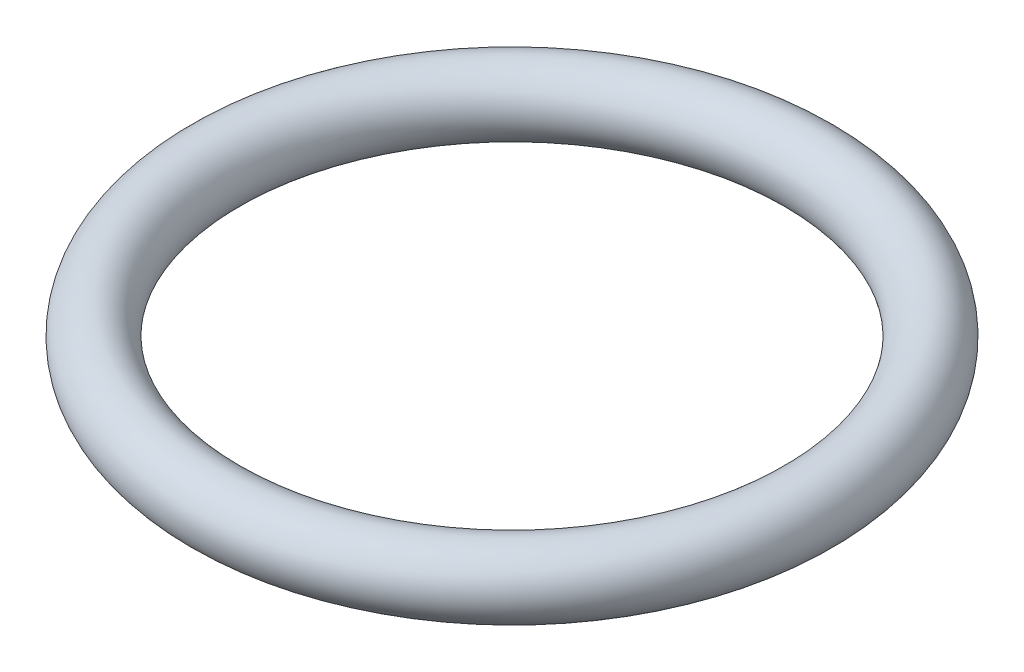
from build123d import *

# Parameters (mm, degrees)
ESQUISSE1_R = 2.65


with BuildPart() as part:
    # Esquisse1 → R_volution1 (revolve)
    with BuildSketch(Plane.XY, mode=Mode.PRIVATE) as r_volution1_sk:
        with Locations((-23.35, 0)):
            Circle(ESQUISSE1_R)
    revolve(r_volution1_sk.sketch.rotate(Axis((0, 0, 0), (0, 1, 0)), 270), axis=Axis((0, 0, 0), (0, 1, 0)))


solid = part.part
